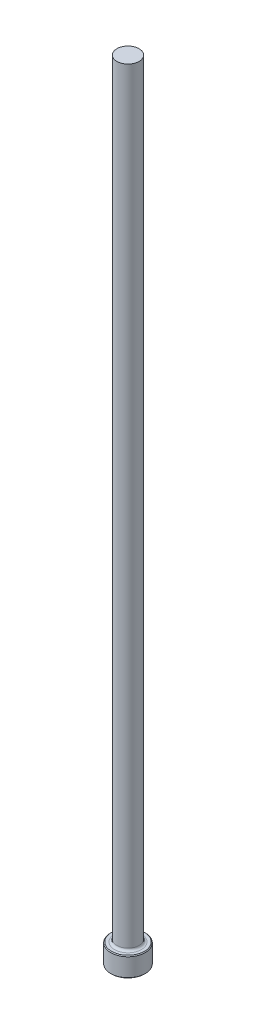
from build123d import *

# Parameters (mm, degrees)
CHAMFER1_SIZE = 0.254
FILLET1_R     = 0.762


with BuildPart() as part:
    # Sketch1 → Revolve1 (revolve)
    with BuildSketch(Plane.XY, mode=Mode.PRIVATE) as revolve1_sk:
        Polygon((0, 0), (-5.5499, 0), (-5.5499, 6.35), (-3.57124, 6.35), (-3.57124, 254), (0, 254), align=None)
    revolve(revolve1_sk.sketch.rotate(Axis((0, 259.958771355, 0), (0, -1, 0)), 270), axis=Axis((0, 259.958771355, 0), (0, -1, 0)))

    # Chamfer1
    chamfer1_edges = [part.edges().sort_by_distance(p)[0] for p in [
        (0, 6.35, -5.5499),
        (0, 0, -5.5499),
    ]]
    chamfer(chamfer1_edges, length=CHAMFER1_SIZE)

    # Fillet1
    fillet1_edges = [part.edges().sort_by_distance(p)[0] for p in [
        (0, 6.35, -3.57124),
    ]]
    fillet(fillet1_edges, radius=FILLET1_R)


solid = part.part
